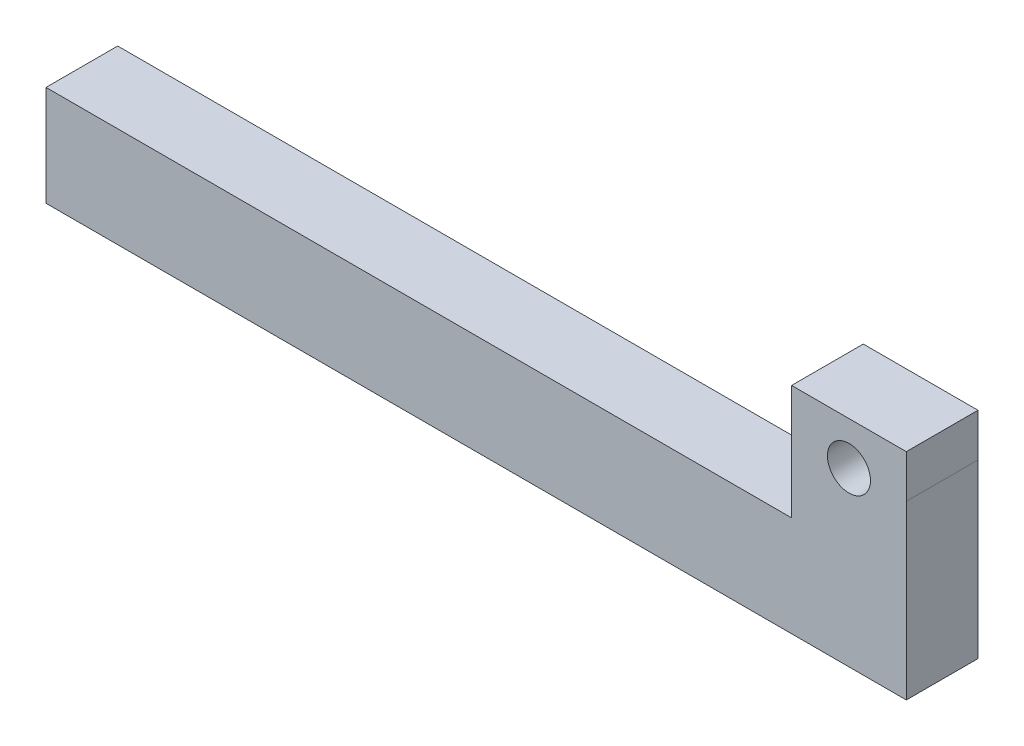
from build123d import *

# Parameters (mm, degrees)
SKETCH1_R      = 7.5
EXTRUDE1_DEPTH = 25


with BuildPart() as part:
    # Sketch1 → Extrude1 (new body)
    with BuildSketch(Plane.XY):
        Polygon((260, 35), (0, 35), (0, 0), (300, 0), (300, 75), (260, 75), align=None)
        with Locations((280, 60)):
            Circle(SKETCH1_R, mode=Mode.SUBTRACT)
    extrude(amount=EXTRUDE1_DEPTH)


solid = part.part
